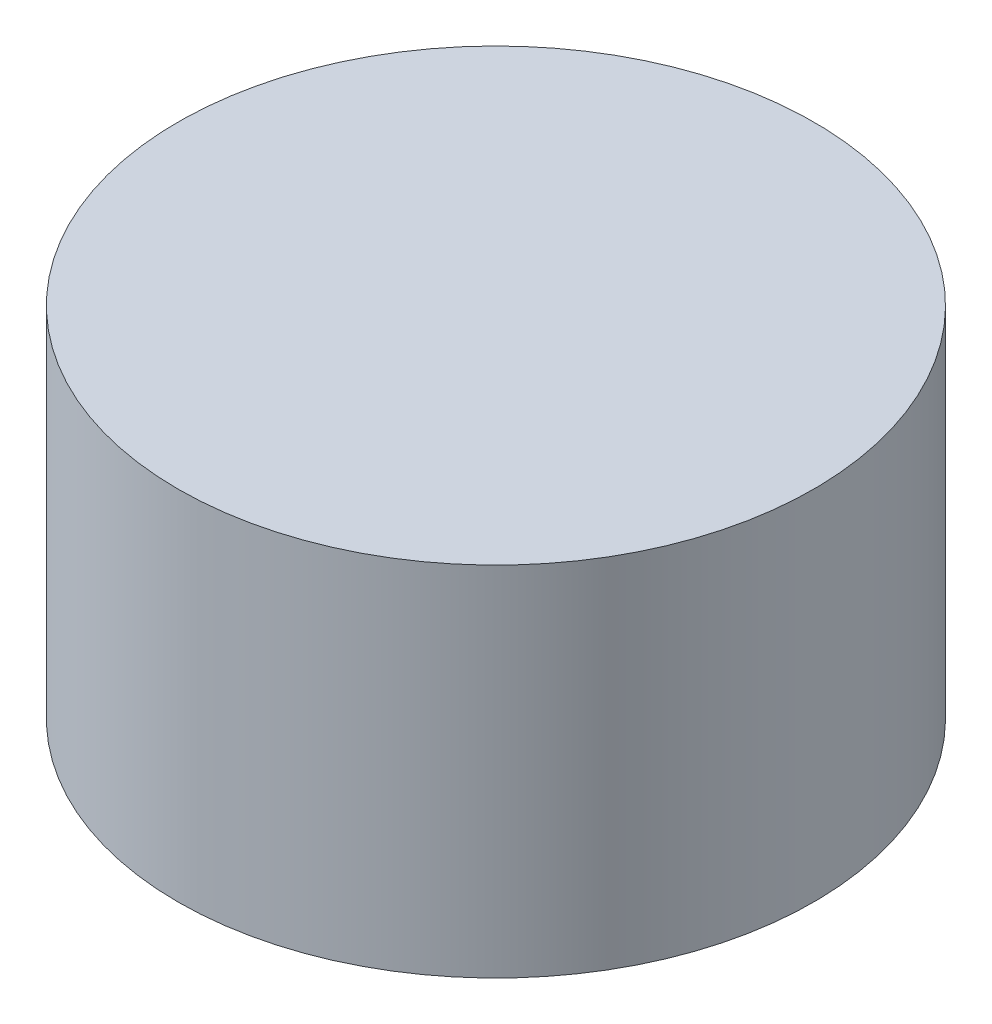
from build123d import *

# Parameters (mm, degrees)
SKETCH1_R           = 4.064
BOSS_EXTRUDE1_DEPTH = 2.286


with BuildPart() as part:
    # Sketch1 → Boss-Extrude1 (new, symmetric)
    with BuildSketch(Plane(origin=(0, 0, 0), x_dir=(1, 0, 0), z_dir=(0, 1, 0))):
        with Locations(Location((0, 0, 0), (0, 0, 270))):
            Circle(SKETCH1_R)
    extrude(amount=BOSS_EXTRUDE1_DEPTH, both=True)


solid = part.part
